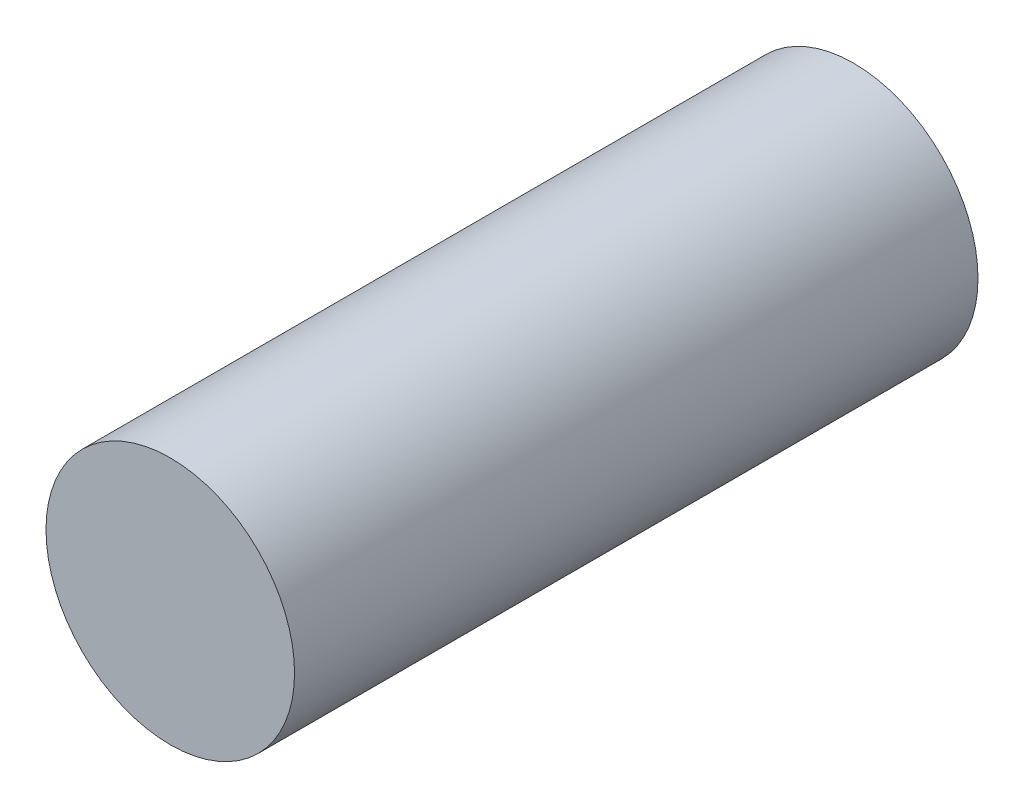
from build123d import *

# Parameters (mm, degrees)
CROQUIS1_R     = 4
EXTRUIR1_DEPTH = 22


with BuildPart() as part:
    # Croquis1 → Extruir1 (new body)
    with BuildSketch(Plane.XY):
        Circle(CROQUIS1_R)
    extrude(amount=EXTRUIR1_DEPTH)


solid = part.part
